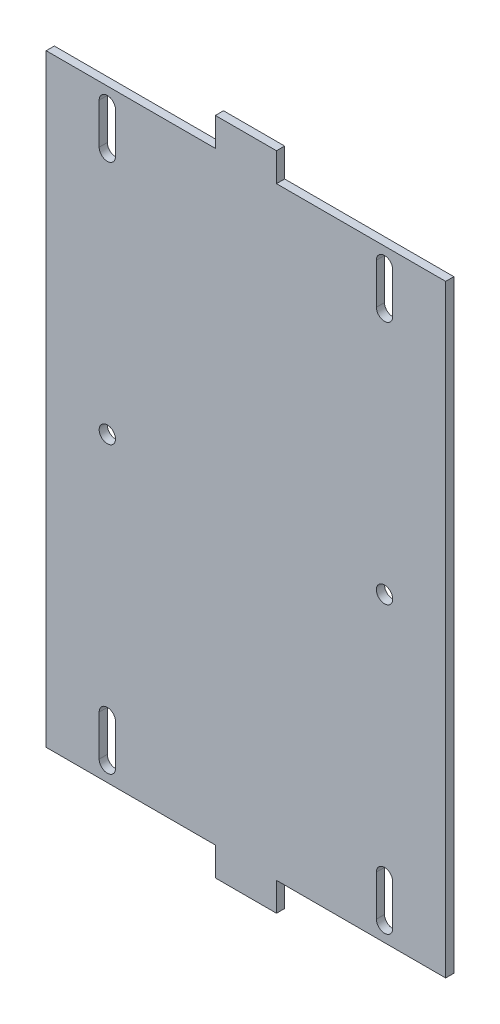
ISO-10303-21;
HEADER;
FILE_DESCRIPTION(('STEP AP214'),'2;1');
FILE_NAME('part.step','',(''),(''),'','','');
FILE_SCHEMA(('AUTOMOTIVE_DESIGN { 1 0 10303 214 1 1 1 1 }'));
ENDSEC;
DATA;
#1=APPLICATION_CONTEXT('core data for automotive mechanical design processes');
#2=APPLICATION_PROTOCOL_DEFINITION('international standard','automotive_design',2000,#1);
#3=PRODUCT_CONTEXT('',#1,'mechanical');
#4=PRODUCT('Part','Part','',(#3));
#5=PRODUCT_RELATED_PRODUCT_CATEGORY('part','',(#4));
#6=PRODUCT_DEFINITION_FORMATION('','',#4);
#7=PRODUCT_DEFINITION_CONTEXT('part definition',#1,'design');
#8=PRODUCT_DEFINITION('design','',#6,#7);
#9=PRODUCT_DEFINITION_SHAPE('','',#8);
#10=(LENGTH_UNIT() NAMED_UNIT(*) SI_UNIT(.MILLI.,.METRE.));
#11=(NAMED_UNIT(*) PLANE_ANGLE_UNIT() SI_UNIT($,.RADIAN.));
#12=(NAMED_UNIT(*) SI_UNIT($,.STERADIAN.) SOLID_ANGLE_UNIT());
#13=UNCERTAINTY_MEASURE_WITH_UNIT(LENGTH_MEASURE(1.E-05),#10,'distance_accuracy_value','');
#14=(GEOMETRIC_REPRESENTATION_CONTEXT(3) GLOBAL_UNCERTAINTY_ASSIGNED_CONTEXT((#13)) GLOBAL_UNIT_ASSIGNED_CONTEXT((#10,
#11,#12)) REPRESENTATION_CONTEXT('',''));
#15=CARTESIAN_POINT('',(0.,0.,0.));
#16=DIRECTION('',(0.,0.,1.));
#17=DIRECTION('',(1.,0.,0.));
#18=AXIS2_PLACEMENT_3D('',#15,#16,#17);
#19=CARTESIAN_POINT('',(-49.,74.,2.));
#20=DIRECTION('',(0.,-1.,0.));
#21=DIRECTION('',(0.,0.,-1.));
#22=AXIS2_PLACEMENT_3D('',#19,#20,#21);
#23=PLANE('',#22);
#24=DIRECTION('',(-1.,0.,0.));
#25=VECTOR('',#24,1.);
#26=CARTESIAN_POINT('',(-49.,74.,0.));
#27=LINE('',#26,#25);
#28=CARTESIAN_POINT('',(-7.49999999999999,74.,0.));
#29=VERTEX_POINT('',#28);
#30=CARTESIAN_POINT('',(-49.,74.,0.));
#31=VERTEX_POINT('',#30);
#32=EDGE_CURVE('E281',#29,#31,#27,.T.);
#33=ORIENTED_EDGE('',*,*,#32,.T.);
#34=DIRECTION('',(0.,0.,-1.));
#35=VECTOR('',#34,1.);
#36=CARTESIAN_POINT('',(-49.,74.,2.));
#37=LINE('',#36,#35);
#38=CARTESIAN_POINT('',(-49.,74.,2.));
#39=VERTEX_POINT('',#38);
#40=EDGE_CURVE('E370',#39,#31,#37,.T.);
#41=ORIENTED_EDGE('',*,*,#40,.F.);
#42=DIRECTION('',(-1.,0.,0.));
#43=VECTOR('',#42,1.);
#44=CARTESIAN_POINT('',(-49.,74.,2.));
#45=LINE('',#44,#43);
#46=CARTESIAN_POINT('',(-7.49999999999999,74.,2.));
#47=VERTEX_POINT('',#46);
#48=EDGE_CURVE('E312',#47,#39,#45,.T.);
#49=ORIENTED_EDGE('',*,*,#48,.F.);
#50=DIRECTION('',(0.,0.,-1.));
#51=VECTOR('',#50,1.);
#52=CARTESIAN_POINT('',(-7.49999999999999,74.,2.));
#53=LINE('',#52,#51);
#54=EDGE_CURVE('E337',#47,#29,#53,.T.);
#55=ORIENTED_EDGE('',*,*,#54,.T.);
#56=EDGE_LOOP('',(#33,#41,#49,#55));
#57=FACE_BOUND('',#56,.T.);
#58=ADVANCED_FACE('F26',(#57),#23,.F.);
#59=CARTESIAN_POINT('',(-49.,-74.,2.));
#60=DIRECTION('',(1.,0.,0.));
#61=DIRECTION('',(0.,0.,-1.));
#62=AXIS2_PLACEMENT_3D('',#59,#60,#61);
#63=PLANE('',#62);
#64=DIRECTION('',(0.,-1.,0.));
#65=VECTOR('',#64,1.);
#66=CARTESIAN_POINT('',(-49.,-74.,0.));
#67=LINE('',#66,#65);
#68=CARTESIAN_POINT('',(-49.,-74.,0.));
#69=VERTEX_POINT('',#68);
#70=EDGE_CURVE('E290',#31,#69,#67,.T.);
#71=ORIENTED_EDGE('',*,*,#70,.T.);
#72=DIRECTION('',(0.,0.,-1.));
#73=VECTOR('',#72,1.);
#74=CARTESIAN_POINT('',(-49.,-74.,2.));
#75=LINE('',#74,#73);
#76=CARTESIAN_POINT('',(-49.,-74.,2.));
#77=VERTEX_POINT('',#76);
#78=EDGE_CURVE('E367',#77,#69,#75,.T.);
#79=ORIENTED_EDGE('',*,*,#78,.F.);
#80=DIRECTION('',(0.,-1.,0.));
#81=VECTOR('',#80,1.);
#82=CARTESIAN_POINT('',(-49.,-74.,2.));
#83=LINE('',#82,#81);
#84=EDGE_CURVE('E315',#39,#77,#83,.T.);
#85=ORIENTED_EDGE('',*,*,#84,.F.);
#86=ORIENTED_EDGE('',*,*,#40,.T.);
#87=EDGE_LOOP('',(#71,#79,#85,#86));
#88=FACE_BOUND('',#87,.T.);
#89=ADVANCED_FACE('F453',(#88),#63,.F.);
#90=CARTESIAN_POINT('',(-49.,-74.,2.));
#91=DIRECTION('',(0.,1.,0.));
#92=DIRECTION('',(0.,0.,1.));
#93=AXIS2_PLACEMENT_3D('',#90,#91,#92);
#94=PLANE('',#93);
#95=DIRECTION('',(1.,0.,0.));
#96=VECTOR('',#95,1.);
#97=CARTESIAN_POINT('',(-49.,-74.,0.));
#98=LINE('',#97,#96);
#99=CARTESIAN_POINT('',(-7.49999999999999,-74.,0.));
#100=VERTEX_POINT('',#99);
#101=EDGE_CURVE('E292',#69,#100,#98,.T.);
#102=ORIENTED_EDGE('',*,*,#101,.T.);
#103=DIRECTION('',(0.,0.,-1.));
#104=VECTOR('',#103,1.);
#105=CARTESIAN_POINT('',(-7.49999999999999,-74.,2.));
#106=LINE('',#105,#104);
#107=CARTESIAN_POINT('',(-7.49999999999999,-74.,2.));
#108=VERTEX_POINT('',#107);
#109=EDGE_CURVE('E364',#108,#100,#106,.T.);
#110=ORIENTED_EDGE('',*,*,#109,.F.);
#111=DIRECTION('',(1.,0.,0.));
#112=VECTOR('',#111,1.);
#113=CARTESIAN_POINT('',(-49.,-74.,2.));
#114=LINE('',#113,#112);
#115=EDGE_CURVE('E317',#77,#108,#114,.T.);
#116=ORIENTED_EDGE('',*,*,#115,.F.);
#117=ORIENTED_EDGE('',*,*,#78,.T.);
#118=EDGE_LOOP('',(#102,#110,#116,#117));
#119=FACE_BOUND('',#118,.T.);
#120=ADVANCED_FACE('F459',(#119),#94,.F.);
#121=CARTESIAN_POINT('',(-7.49999999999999,-74.,2.));
#122=DIRECTION('',(1.,0.,0.));
#123=DIRECTION('',(0.,0.,-1.));
#124=AXIS2_PLACEMENT_3D('',#121,#122,#123);
#125=PLANE('',#124);
#126=DIRECTION('',(0.,-1.,0.));
#127=VECTOR('',#126,1.);
#128=CARTESIAN_POINT('',(-7.49999999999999,-74.,0.));
#129=LINE('',#128,#127);
#130=CARTESIAN_POINT('',(-7.49999999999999,-81.,0.));
#131=VERTEX_POINT('',#130);
#132=EDGE_CURVE('E294',#100,#131,#129,.T.);
#133=ORIENTED_EDGE('',*,*,#132,.T.);
#134=DIRECTION('',(0.,0.,-1.));
#135=VECTOR('',#134,1.);
#136=CARTESIAN_POINT('',(-7.49999999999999,-81.,2.));
#137=LINE('',#136,#135);
#138=CARTESIAN_POINT('',(-7.49999999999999,-81.,2.));
#139=VERTEX_POINT('',#138);
#140=EDGE_CURVE('E361',#139,#131,#137,.T.);
#141=ORIENTED_EDGE('',*,*,#140,.F.);
#142=DIRECTION('',(0.,-1.,0.));
#143=VECTOR('',#142,1.);
#144=CARTESIAN_POINT('',(-7.49999999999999,-74.,2.));
#145=LINE('',#144,#143);
#146=EDGE_CURVE('E319',#108,#139,#145,.T.);
#147=ORIENTED_EDGE('',*,*,#146,.F.);
#148=ORIENTED_EDGE('',*,*,#109,.T.);
#149=EDGE_LOOP('',(#133,#141,#147,#148));
#150=FACE_BOUND('',#149,.T.);
#151=ADVANCED_FACE('F548',(#150),#125,.F.);
#152=CARTESIAN_POINT('',(-7.49999999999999,-81.,2.));
#153=DIRECTION('',(0.,1.,0.));
#154=DIRECTION('',(0.,0.,1.));
#155=AXIS2_PLACEMENT_3D('',#152,#153,#154);
#156=PLANE('',#155);
#157=DIRECTION('',(1.,0.,0.));
#158=VECTOR('',#157,1.);
#159=CARTESIAN_POINT('',(-7.49999999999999,-81.,0.));
#160=LINE('',#159,#158);
#161=CARTESIAN_POINT('',(7.49999999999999,-81.,0.));
#162=VERTEX_POINT('',#161);
#163=EDGE_CURVE('E296',#131,#162,#160,.T.);
#164=ORIENTED_EDGE('',*,*,#163,.T.);
#165=DIRECTION('',(0.,0.,-1.));
#166=VECTOR('',#165,1.);
#167=CARTESIAN_POINT('',(7.49999999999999,-81.,2.));
#168=LINE('',#167,#166);
#169=CARTESIAN_POINT('',(7.49999999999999,-81.,2.));
#170=VERTEX_POINT('',#169);
#171=EDGE_CURVE('E358',#170,#162,#168,.T.);
#172=ORIENTED_EDGE('',*,*,#171,.F.);
#173=DIRECTION('',(1.,0.,0.));
#174=VECTOR('',#173,1.);
#175=CARTESIAN_POINT('',(-7.49999999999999,-81.,2.));
#176=LINE('',#175,#174);
#177=EDGE_CURVE('E321',#139,#170,#176,.T.);
#178=ORIENTED_EDGE('',*,*,#177,.F.);
#179=ORIENTED_EDGE('',*,*,#140,.T.);
#180=EDGE_LOOP('',(#164,#172,#178,#179));
#181=FACE_BOUND('',#180,.T.);
#182=ADVANCED_FACE('F544',(#181),#156,.F.);
#183=CARTESIAN_POINT('',(7.49999999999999,-74.,2.));
#184=DIRECTION('',(-1.,0.,0.));
#185=DIRECTION('',(0.,0.,1.));
#186=AXIS2_PLACEMENT_3D('',#183,#184,#185);
#187=PLANE('',#186);
#188=DIRECTION('',(0.,1.,0.));
#189=VECTOR('',#188,1.);
#190=CARTESIAN_POINT('',(7.49999999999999,-74.,0.));
#191=LINE('',#190,#189);
#192=CARTESIAN_POINT('',(7.49999999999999,-74.,0.));
#193=VERTEX_POINT('',#192);
#194=EDGE_CURVE('E298',#162,#193,#191,.T.);
#195=ORIENTED_EDGE('',*,*,#194,.T.);
#196=DIRECTION('',(0.,0.,-1.));
#197=VECTOR('',#196,1.);
#198=CARTESIAN_POINT('',(7.49999999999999,-74.,2.));
#199=LINE('',#198,#197);
#200=CARTESIAN_POINT('',(7.49999999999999,-74.,2.));
#201=VERTEX_POINT('',#200);
#202=EDGE_CURVE('E355',#201,#193,#199,.T.);
#203=ORIENTED_EDGE('',*,*,#202,.F.);
#204=DIRECTION('',(0.,1.,0.));
#205=VECTOR('',#204,1.);
#206=CARTESIAN_POINT('',(7.49999999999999,-74.,2.));
#207=LINE('',#206,#205);
#208=EDGE_CURVE('E323',#170,#201,#207,.T.);
#209=ORIENTED_EDGE('',*,*,#208,.F.);
#210=ORIENTED_EDGE('',*,*,#171,.T.);
#211=EDGE_LOOP('',(#195,#203,#209,#210));
#212=FACE_BOUND('',#211,.T.);
#213=ADVANCED_FACE('F540',(#212),#187,.F.);
#214=CARTESIAN_POINT('',(49.,-74.,2.));
#215=DIRECTION('',(0.,1.,0.));
#216=DIRECTION('',(0.,0.,1.));
#217=AXIS2_PLACEMENT_3D('',#214,#215,#216);
#218=PLANE('',#217);
#219=DIRECTION('',(1.,0.,0.));
#220=VECTOR('',#219,1.);
#221=CARTESIAN_POINT('',(49.,-74.,0.));
#222=LINE('',#221,#220);
#223=CARTESIAN_POINT('',(49.,-74.,0.));
#224=VERTEX_POINT('',#223);
#225=EDGE_CURVE('E300',#193,#224,#222,.T.);
#226=ORIENTED_EDGE('',*,*,#225,.T.);
#227=DIRECTION('',(0.,0.,-1.));
#228=VECTOR('',#227,1.);
#229=CARTESIAN_POINT('',(49.,-74.,2.));
#230=LINE('',#229,#228);
#231=CARTESIAN_POINT('',(49.,-74.,2.));
#232=VERTEX_POINT('',#231);
#233=EDGE_CURVE('E352',#232,#224,#230,.T.);
#234=ORIENTED_EDGE('',*,*,#233,.F.);
#235=DIRECTION('',(1.,0.,0.));
#236=VECTOR('',#235,1.);
#237=CARTESIAN_POINT('',(49.,-74.,2.));
#238=LINE('',#237,#236);
#239=EDGE_CURVE('E325',#201,#232,#238,.T.);
#240=ORIENTED_EDGE('',*,*,#239,.F.);
#241=ORIENTED_EDGE('',*,*,#202,.T.);
#242=EDGE_LOOP('',(#226,#234,#240,#241));
#243=FACE_BOUND('',#242,.T.);
#244=ADVANCED_FACE('F536',(#243),#218,.F.);
#245=CARTESIAN_POINT('',(49.,-74.,2.));
#246=DIRECTION('',(-1.,0.,0.));
#247=DIRECTION('',(0.,0.,1.));
#248=AXIS2_PLACEMENT_3D('',#245,#246,#247);
#249=PLANE('',#248);
#250=DIRECTION('',(0.,1.,0.));
#251=VECTOR('',#250,1.);
#252=CARTESIAN_POINT('',(49.,-74.,0.));
#253=LINE('',#252,#251);
#254=CARTESIAN_POINT('',(49.,74.,0.));
#255=VERTEX_POINT('',#254);
#256=EDGE_CURVE('E302',#224,#255,#253,.T.);
#257=ORIENTED_EDGE('',*,*,#256,.T.);
#258=DIRECTION('',(0.,0.,-1.));
#259=VECTOR('',#258,1.);
#260=CARTESIAN_POINT('',(49.,74.,2.));
#261=LINE('',#260,#259);
#262=CARTESIAN_POINT('',(49.,74.,2.));
#263=VERTEX_POINT('',#262);
#264=EDGE_CURVE('E349',#263,#255,#261,.T.);
#265=ORIENTED_EDGE('',*,*,#264,.F.);
#266=DIRECTION('',(0.,1.,0.));
#267=VECTOR('',#266,1.);
#268=CARTESIAN_POINT('',(49.,-74.,2.));
#269=LINE('',#268,#267);
#270=EDGE_CURVE('E327',#232,#263,#269,.T.);
#271=ORIENTED_EDGE('',*,*,#270,.F.);
#272=ORIENTED_EDGE('',*,*,#233,.T.);
#273=EDGE_LOOP('',(#257,#265,#271,#272));
#274=FACE_BOUND('',#273,.T.);
#275=ADVANCED_FACE('F532',(#274),#249,.F.);
#276=CARTESIAN_POINT('',(49.,74.,2.));
#277=DIRECTION('',(0.,-1.,0.));
#278=DIRECTION('',(0.,0.,-1.));
#279=AXIS2_PLACEMENT_3D('',#276,#277,#278);
#280=PLANE('',#279);
#281=DIRECTION('',(-1.,0.,0.));
#282=VECTOR('',#281,1.);
#283=CARTESIAN_POINT('',(49.,74.,0.));
#284=LINE('',#283,#282);
#285=CARTESIAN_POINT('',(7.49999999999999,74.,0.));
#286=VERTEX_POINT('',#285);
#287=EDGE_CURVE('E304',#255,#286,#284,.T.);
#288=ORIENTED_EDGE('',*,*,#287,.T.);
#289=DIRECTION('',(0.,0.,-1.));
#290=VECTOR('',#289,1.);
#291=CARTESIAN_POINT('',(7.49999999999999,74.,2.));
#292=LINE('',#291,#290);
#293=CARTESIAN_POINT('',(7.49999999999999,74.,2.));
#294=VERTEX_POINT('',#293);
#295=EDGE_CURVE('E346',#294,#286,#292,.T.);
#296=ORIENTED_EDGE('',*,*,#295,.F.);
#297=DIRECTION('',(-1.,0.,0.));
#298=VECTOR('',#297,1.);
#299=CARTESIAN_POINT('',(49.,74.,2.));
#300=LINE('',#299,#298);
#301=EDGE_CURVE('E329',#263,#294,#300,.T.);
#302=ORIENTED_EDGE('',*,*,#301,.F.);
#303=ORIENTED_EDGE('',*,*,#264,.T.);
#304=EDGE_LOOP('',(#288,#296,#302,#303));
#305=FACE_BOUND('',#304,.T.);
#306=ADVANCED_FACE('F528',(#305),#280,.F.);
#307=CARTESIAN_POINT('',(7.49999999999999,74.,2.));
#308=DIRECTION('',(-1.,0.,0.));
#309=DIRECTION('',(0.,0.,1.));
#310=AXIS2_PLACEMENT_3D('',#307,#308,#309);
#311=PLANE('',#310);
#312=DIRECTION('',(0.,1.,0.));
#313=VECTOR('',#312,1.);
#314=CARTESIAN_POINT('',(7.49999999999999,74.,0.));
#315=LINE('',#314,#313);
#316=CARTESIAN_POINT('',(7.49999999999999,81.,0.));
#317=VERTEX_POINT('',#316);
#318=EDGE_CURVE('E306',#286,#317,#315,.T.);
#319=ORIENTED_EDGE('',*,*,#318,.T.);
#320=DIRECTION('',(0.,0.,-1.));
#321=VECTOR('',#320,1.);
#322=CARTESIAN_POINT('',(7.49999999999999,81.,2.));
#323=LINE('',#322,#321);
#324=CARTESIAN_POINT('',(7.49999999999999,81.,2.));
#325=VERTEX_POINT('',#324);
#326=EDGE_CURVE('E343',#325,#317,#323,.T.);
#327=ORIENTED_EDGE('',*,*,#326,.F.);
#328=DIRECTION('',(0.,1.,0.));
#329=VECTOR('',#328,1.);
#330=CARTESIAN_POINT('',(7.49999999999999,74.,2.));
#331=LINE('',#330,#329);
#332=EDGE_CURVE('E331',#294,#325,#331,.T.);
#333=ORIENTED_EDGE('',*,*,#332,.F.);
#334=ORIENTED_EDGE('',*,*,#295,.T.);
#335=EDGE_LOOP('',(#319,#327,#333,#334));
#336=FACE_BOUND('',#335,.T.);
#337=ADVANCED_FACE('F524',(#336),#311,.F.);
#338=CARTESIAN_POINT('',(-7.49999999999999,81.,2.));
#339=DIRECTION('',(0.,-1.,0.));
#340=DIRECTION('',(0.,0.,-1.));
#341=AXIS2_PLACEMENT_3D('',#338,#339,#340);
#342=PLANE('',#341);
#343=DIRECTION('',(-1.,0.,0.));
#344=VECTOR('',#343,1.);
#345=CARTESIAN_POINT('',(-7.49999999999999,81.,0.));
#346=LINE('',#345,#344);
#347=CARTESIAN_POINT('',(-7.49999999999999,81.,0.));
#348=VERTEX_POINT('',#347);
#349=EDGE_CURVE('E308',#317,#348,#346,.T.);
#350=ORIENTED_EDGE('',*,*,#349,.T.);
#351=DIRECTION('',(0.,0.,-1.));
#352=VECTOR('',#351,1.);
#353=CARTESIAN_POINT('',(-7.49999999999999,81.,2.));
#354=LINE('',#353,#352);
#355=CARTESIAN_POINT('',(-7.49999999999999,81.,2.));
#356=VERTEX_POINT('',#355);
#357=EDGE_CURVE('E340',#356,#348,#354,.T.);
#358=ORIENTED_EDGE('',*,*,#357,.F.);
#359=DIRECTION('',(-1.,0.,0.));
#360=VECTOR('',#359,1.);
#361=CARTESIAN_POINT('',(-7.49999999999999,81.,2.));
#362=LINE('',#361,#360);
#363=EDGE_CURVE('E333',#325,#356,#362,.T.);
#364=ORIENTED_EDGE('',*,*,#363,.F.);
#365=ORIENTED_EDGE('',*,*,#326,.T.);
#366=EDGE_LOOP('',(#350,#358,#364,#365));
#367=FACE_BOUND('',#366,.T.);
#368=ADVANCED_FACE('F520',(#367),#342,.F.);
#369=CARTESIAN_POINT('',(-7.49999999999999,74.,2.));
#370=DIRECTION('',(1.,0.,0.));
#371=DIRECTION('',(0.,0.,-1.));
#372=AXIS2_PLACEMENT_3D('',#369,#370,#371);
#373=PLANE('',#372);
#374=DIRECTION('',(0.,-1.,0.));
#375=VECTOR('',#374,1.);
#376=CARTESIAN_POINT('',(-7.49999999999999,74.,0.));
#377=LINE('',#376,#375);
#378=EDGE_CURVE('E310',#348,#29,#377,.T.);
#379=ORIENTED_EDGE('',*,*,#378,.T.);
#380=ORIENTED_EDGE('',*,*,#54,.F.);
#381=DIRECTION('',(0.,-1.,0.));
#382=VECTOR('',#381,1.);
#383=CARTESIAN_POINT('',(-7.49999999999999,74.,2.));
#384=LINE('',#383,#382);
#385=EDGE_CURVE('E335',#356,#47,#384,.T.);
#386=ORIENTED_EDGE('',*,*,#385,.F.);
#387=ORIENTED_EDGE('',*,*,#357,.T.);
#388=EDGE_LOOP('',(#379,#380,#386,#387));
#389=FACE_BOUND('',#388,.T.);
#390=ADVANCED_FACE('F516',(#389),#373,.F.);
#391=CARTESIAN_POINT('',(-7.49999999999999,74.,2.));
#392=DIRECTION('',(0.,0.,1.));
#393=DIRECTION('',(1.,0.,0.));
#394=AXIS2_PLACEMENT_3D('',#391,#392,#393);
#395=PLANE('',#394);
#396=CARTESIAN_POINT('',(34.,0.,2.));
#397=DIRECTION('',(0.,0.,1.));
#398=DIRECTION('',(1.,0.,0.));
#399=AXIS2_PLACEMENT_3D('',#396,#397,#398);
#400=CIRCLE('',#399,2.);
#401=CARTESIAN_POINT('',(36.,0.,2.));
#402=VERTEX_POINT('',#401);
#403=EDGE_CURVE('E725',#402,#402,#400,.T.);
#404=ORIENTED_EDGE('',*,*,#403,.F.);
#405=EDGE_LOOP('',(#404));
#406=FACE_BOUND('',#405,.T.);
#407=CARTESIAN_POINT('',(-34.,0.,2.));
#408=DIRECTION('',(0.,0.,1.));
#409=DIRECTION('',(1.,0.,0.));
#410=AXIS2_PLACEMENT_3D('',#407,#408,#409);
#411=CIRCLE('',#410,2.);
#412=CARTESIAN_POINT('',(-32.,0.,2.));
#413=VERTEX_POINT('',#412);
#414=EDGE_CURVE('E729',#413,#413,#411,.T.);
#415=ORIENTED_EDGE('',*,*,#414,.F.);
#416=EDGE_LOOP('',(#415));
#417=FACE_BOUND('',#416,.T.);
#418=CARTESIAN_POINT('',(34.,70.,2.));
#419=DIRECTION('',(0.,0.,1.));
#420=DIRECTION('',(-1.,0.,0.));
#421=AXIS2_PLACEMENT_3D('',#418,#419,#420);
#422=CIRCLE('',#421,2.);
#423=CARTESIAN_POINT('',(36.,70.,2.));
#424=VERTEX_POINT('',#423);
#425=CARTESIAN_POINT('',(32.,70.,2.));
#426=VERTEX_POINT('',#425);
#427=EDGE_CURVE('E250',#424,#426,#422,.T.);
#428=ORIENTED_EDGE('',*,*,#427,.F.);
#429=DIRECTION('',(0.,1.,0.));
#430=VECTOR('',#429,1.);
#431=CARTESIAN_POINT('',(36.,70.,2.));
#432=LINE('',#431,#430);
#433=CARTESIAN_POINT('',(36.,60.,2.));
#434=VERTEX_POINT('',#433);
#435=EDGE_CURVE('E236',#434,#424,#432,.T.);
#436=ORIENTED_EDGE('',*,*,#435,.F.);
#437=CARTESIAN_POINT('',(34.,60.,2.));
#438=DIRECTION('',(0.,0.,1.));
#439=DIRECTION('',(1.,0.,0.));
#440=AXIS2_PLACEMENT_3D('',#437,#438,#439);
#441=CIRCLE('',#440,2.);
#442=CARTESIAN_POINT('',(32.,60.,2.));
#443=VERTEX_POINT('',#442);
#444=EDGE_CURVE('E228',#443,#434,#441,.T.);
#445=ORIENTED_EDGE('',*,*,#444,.F.);
#446=DIRECTION('',(0.,-1.,0.));
#447=VECTOR('',#446,1.);
#448=CARTESIAN_POINT('',(32.,70.,2.));
#449=LINE('',#448,#447);
#450=EDGE_CURVE('E214',#426,#443,#449,.T.);
#451=ORIENTED_EDGE('',*,*,#450,.F.);
#452=EDGE_LOOP('',(#428,#436,#445,#451));
#453=FACE_BOUND('',#452,.T.);
#454=CARTESIAN_POINT('',(-34.,70.,2.));
#455=DIRECTION('',(0.,0.,1.));
#456=DIRECTION('',(-1.,0.,0.));
#457=AXIS2_PLACEMENT_3D('',#454,#455,#456);
#458=CIRCLE('',#457,2.);
#459=CARTESIAN_POINT('',(-32.,70.,2.));
#460=VERTEX_POINT('',#459);
#461=CARTESIAN_POINT('',(-36.,70.,2.));
#462=VERTEX_POINT('',#461);
#463=EDGE_CURVE('E255',#460,#462,#458,.T.);
#464=ORIENTED_EDGE('',*,*,#463,.F.);
#465=DIRECTION('',(0.,1.,0.));
#466=VECTOR('',#465,1.);
#467=CARTESIAN_POINT('',(-32.,70.,2.));
#468=LINE('',#467,#466);
#469=CARTESIAN_POINT('',(-32.,60.,2.));
#470=VERTEX_POINT('',#469);
#471=EDGE_CURVE('E263',#470,#460,#468,.T.);
#472=ORIENTED_EDGE('',*,*,#471,.F.);
#473=CARTESIAN_POINT('',(-34.,60.,2.));
#474=DIRECTION('',(0.,0.,1.));
#475=DIRECTION('',(1.,0.,0.));
#476=AXIS2_PLACEMENT_3D('',#473,#474,#475);
#477=CIRCLE('',#476,2.);
#478=CARTESIAN_POINT('',(-36.,60.,2.));
#479=VERTEX_POINT('',#478);
#480=EDGE_CURVE('E260',#479,#470,#477,.T.);
#481=ORIENTED_EDGE('',*,*,#480,.F.);
#482=DIRECTION('',(0.,-1.,0.));
#483=VECTOR('',#482,1.);
#484=CARTESIAN_POINT('',(-36.,70.,2.));
#485=LINE('',#484,#483);
#486=EDGE_CURVE('E257',#462,#479,#485,.T.);
#487=ORIENTED_EDGE('',*,*,#486,.F.);
#488=EDGE_LOOP('',(#464,#472,#481,#487));
#489=FACE_BOUND('',#488,.T.);
#490=ORIENTED_EDGE('',*,*,#48,.T.);
#491=ORIENTED_EDGE('',*,*,#84,.T.);
#492=ORIENTED_EDGE('',*,*,#115,.T.);
#493=ORIENTED_EDGE('',*,*,#146,.T.);
#494=ORIENTED_EDGE('',*,*,#177,.T.);
#495=ORIENTED_EDGE('',*,*,#208,.T.);
#496=ORIENTED_EDGE('',*,*,#239,.T.);
#497=ORIENTED_EDGE('',*,*,#270,.T.);
#498=ORIENTED_EDGE('',*,*,#301,.T.);
#499=ORIENTED_EDGE('',*,*,#332,.T.);
#500=ORIENTED_EDGE('',*,*,#363,.T.);
#501=ORIENTED_EDGE('',*,*,#385,.T.);
#502=EDGE_LOOP('',(#490,#491,#492,#493,#494,#495,#496,#497,#498,#499,#500,#501));
#503=FACE_BOUND('',#502,.T.);
#504=CARTESIAN_POINT('',(-34.,-60.,2.));
#505=DIRECTION('',(0.,0.,1.));
#506=DIRECTION('',(-1.,0.,0.));
#507=AXIS2_PLACEMENT_3D('',#504,#505,#506);
#508=CIRCLE('',#507,2.);
#509=CARTESIAN_POINT('',(-32.,-60.,2.));
#510=VERTEX_POINT('',#509);
#511=CARTESIAN_POINT('',(-36.,-60.,2.));
#512=VERTEX_POINT('',#511);
#513=EDGE_CURVE('E373',#510,#512,#508,.T.);
#514=ORIENTED_EDGE('',*,*,#513,.F.);
#515=DIRECTION('',(0.,1.,0.));
#516=VECTOR('',#515,1.);
#517=CARTESIAN_POINT('',(-32.,-60.,2.));
#518=LINE('',#517,#516);
#519=CARTESIAN_POINT('',(-32.,-70.,2.));
#520=VERTEX_POINT('',#519);
#521=EDGE_CURVE('E375',#520,#510,#518,.T.);
#522=ORIENTED_EDGE('',*,*,#521,.F.);
#523=CARTESIAN_POINT('',(-34.,-70.,2.));
#524=DIRECTION('',(0.,0.,1.));
#525=DIRECTION('',(1.,0.,0.));
#526=AXIS2_PLACEMENT_3D('',#523,#524,#525);
#527=CIRCLE('',#526,2.);
#528=CARTESIAN_POINT('',(-36.,-70.,2.));
#529=VERTEX_POINT('',#528);
#530=EDGE_CURVE('E378',#529,#520,#527,.T.);
#531=ORIENTED_EDGE('',*,*,#530,.F.);
#532=DIRECTION('',(0.,-1.,0.));
#533=VECTOR('',#532,1.);
#534=CARTESIAN_POINT('',(-36.,-60.,2.));
#535=LINE('',#534,#533);
#536=EDGE_CURVE('E381',#512,#529,#535,.T.);
#537=ORIENTED_EDGE('',*,*,#536,.F.);
#538=EDGE_LOOP('',(#514,#522,#531,#537));
#539=FACE_BOUND('',#538,.T.);
#540=CARTESIAN_POINT('',(34.,-60.,2.));
#541=DIRECTION('',(0.,0.,1.));
#542=DIRECTION('',(-1.,0.,0.));
#543=AXIS2_PLACEMENT_3D('',#540,#541,#542);
#544=CIRCLE('',#543,2.);
#545=CARTESIAN_POINT('',(36.,-60.,2.));
#546=VERTEX_POINT('',#545);
#547=CARTESIAN_POINT('',(32.,-60.,2.));
#548=VERTEX_POINT('',#547);
#549=EDGE_CURVE('E405',#546,#548,#544,.T.);
#550=ORIENTED_EDGE('',*,*,#549,.F.);
#551=DIRECTION('',(0.,1.,0.));
#552=VECTOR('',#551,1.);
#553=CARTESIAN_POINT('',(36.,-60.,2.));
#554=LINE('',#553,#552);
#555=CARTESIAN_POINT('',(36.,-70.,2.));
#556=VERTEX_POINT('',#555);
#557=EDGE_CURVE('E407',#556,#546,#554,.T.);
#558=ORIENTED_EDGE('',*,*,#557,.F.);
#559=CARTESIAN_POINT('',(34.,-70.,2.));
#560=DIRECTION('',(0.,0.,1.));
#561=DIRECTION('',(1.,0.,0.));
#562=AXIS2_PLACEMENT_3D('',#559,#560,#561);
#563=CIRCLE('',#562,2.);
#564=CARTESIAN_POINT('',(32.,-70.,2.));
#565=VERTEX_POINT('',#564);
#566=EDGE_CURVE('E410',#565,#556,#563,.T.);
#567=ORIENTED_EDGE('',*,*,#566,.F.);
#568=DIRECTION('',(0.,-1.,0.));
#569=VECTOR('',#568,1.);
#570=CARTESIAN_POINT('',(32.,-60.,2.));
#571=LINE('',#570,#569);
#572=EDGE_CURVE('E413',#548,#565,#571,.T.);
#573=ORIENTED_EDGE('',*,*,#572,.F.);
#574=EDGE_LOOP('',(#550,#558,#567,#573));
#575=FACE_BOUND('',#574,.T.);
#576=ADVANCED_FACE('F234',(#406,#417,#453,#489,#503,#539,#575),#395,.T.);
#577=CARTESIAN_POINT('',(-7.49999999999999,74.,0.));
#578=DIRECTION('',(0.,0.,1.));
#579=DIRECTION('',(1.,0.,0.));
#580=AXIS2_PLACEMENT_3D('',#577,#578,#579);
#581=PLANE('',#580);
#582=CARTESIAN_POINT('',(34.,0.,0.));
#583=DIRECTION('',(0.,0.,1.));
#584=DIRECTION('',(1.,0.,0.));
#585=AXIS2_PLACEMENT_3D('',#582,#583,#584);
#586=CIRCLE('',#585,2.);
#587=CARTESIAN_POINT('',(36.,0.,0.));
#588=VERTEX_POINT('',#587);
#589=EDGE_CURVE('E728',#588,#588,#586,.T.);
#590=ORIENTED_EDGE('',*,*,#589,.T.);
#591=EDGE_LOOP('',(#590));
#592=FACE_BOUND('',#591,.T.);
#593=CARTESIAN_POINT('',(-34.,0.,0.));
#594=DIRECTION('',(0.,0.,1.));
#595=DIRECTION('',(1.,0.,0.));
#596=AXIS2_PLACEMENT_3D('',#593,#594,#595);
#597=CIRCLE('',#596,2.);
#598=CARTESIAN_POINT('',(-32.,0.,0.));
#599=VERTEX_POINT('',#598);
#600=EDGE_CURVE('E30',#599,#599,#597,.T.);
#601=ORIENTED_EDGE('',*,*,#600,.T.);
#602=EDGE_LOOP('',(#601));
#603=FACE_BOUND('',#602,.T.);
#604=DIRECTION('',(0.,1.,0.));
#605=VECTOR('',#604,1.);
#606=CARTESIAN_POINT('',(36.,70.,0.));
#607=LINE('',#606,#605);
#608=CARTESIAN_POINT('',(36.,60.,0.));
#609=VERTEX_POINT('',#608);
#610=CARTESIAN_POINT('',(36.,70.,0.));
#611=VERTEX_POINT('',#610);
#612=EDGE_CURVE('E247',#609,#611,#607,.T.);
#613=ORIENTED_EDGE('',*,*,#612,.T.);
#614=CARTESIAN_POINT('',(34.,70.,0.));
#615=DIRECTION('',(0.,0.,1.));
#616=DIRECTION('',(-1.,0.,0.));
#617=AXIS2_PLACEMENT_3D('',#614,#615,#616);
#618=CIRCLE('',#617,2.);
#619=CARTESIAN_POINT('',(32.,70.,0.));
#620=VERTEX_POINT('',#619);
#621=EDGE_CURVE('E252',#611,#620,#618,.T.);
#622=ORIENTED_EDGE('',*,*,#621,.T.);
#623=DIRECTION('',(0.,-1.,0.));
#624=VECTOR('',#623,1.);
#625=CARTESIAN_POINT('',(32.,70.,0.));
#626=LINE('',#625,#624);
#627=CARTESIAN_POINT('',(32.,60.,0.));
#628=VERTEX_POINT('',#627);
#629=EDGE_CURVE('E224',#620,#628,#626,.T.);
#630=ORIENTED_EDGE('',*,*,#629,.T.);
#631=CARTESIAN_POINT('',(34.,60.,0.));
#632=DIRECTION('',(0.,0.,1.));
#633=DIRECTION('',(1.,0.,0.));
#634=AXIS2_PLACEMENT_3D('',#631,#632,#633);
#635=CIRCLE('',#634,2.);
#636=EDGE_CURVE('E231',#628,#609,#635,.T.);
#637=ORIENTED_EDGE('',*,*,#636,.T.);
#638=EDGE_LOOP('',(#613,#622,#630,#637));
#639=FACE_BOUND('',#638,.T.);
#640=DIRECTION('',(0.,1.,0.));
#641=VECTOR('',#640,1.);
#642=CARTESIAN_POINT('',(-32.,70.,0.));
#643=LINE('',#642,#641);
#644=CARTESIAN_POINT('',(-32.,60.,0.));
#645=VERTEX_POINT('',#644);
#646=CARTESIAN_POINT('',(-32.,70.,0.));
#647=VERTEX_POINT('',#646);
#648=EDGE_CURVE('E275',#645,#647,#643,.T.);
#649=ORIENTED_EDGE('',*,*,#648,.T.);
#650=CARTESIAN_POINT('',(-34.,70.,0.));
#651=DIRECTION('',(0.,0.,1.));
#652=DIRECTION('',(-1.,0.,0.));
#653=AXIS2_PLACEMENT_3D('',#650,#651,#652);
#654=CIRCLE('',#653,2.);
#655=CARTESIAN_POINT('',(-36.,70.,0.));
#656=VERTEX_POINT('',#655);
#657=EDGE_CURVE('E266',#647,#656,#654,.T.);
#658=ORIENTED_EDGE('',*,*,#657,.T.);
#659=DIRECTION('',(0.,-1.,0.));
#660=VECTOR('',#659,1.);
#661=CARTESIAN_POINT('',(-36.,70.,0.));
#662=LINE('',#661,#660);
#663=CARTESIAN_POINT('',(-36.,60.,0.));
#664=VERTEX_POINT('',#663);
#665=EDGE_CURVE('E269',#656,#664,#662,.T.);
#666=ORIENTED_EDGE('',*,*,#665,.T.);
#667=CARTESIAN_POINT('',(-34.,60.,0.));
#668=DIRECTION('',(0.,0.,1.));
#669=DIRECTION('',(1.,0.,0.));
#670=AXIS2_PLACEMENT_3D('',#667,#668,#669);
#671=CIRCLE('',#670,2.);
#672=EDGE_CURVE('E272',#664,#645,#671,.T.);
#673=ORIENTED_EDGE('',*,*,#672,.T.);
#674=EDGE_LOOP('',(#649,#658,#666,#673));
#675=FACE_BOUND('',#674,.T.);
#676=ORIENTED_EDGE('',*,*,#32,.F.);
#677=ORIENTED_EDGE('',*,*,#378,.F.);
#678=ORIENTED_EDGE('',*,*,#349,.F.);
#679=ORIENTED_EDGE('',*,*,#318,.F.);
#680=ORIENTED_EDGE('',*,*,#287,.F.);
#681=ORIENTED_EDGE('',*,*,#256,.F.);
#682=ORIENTED_EDGE('',*,*,#225,.F.);
#683=ORIENTED_EDGE('',*,*,#194,.F.);
#684=ORIENTED_EDGE('',*,*,#163,.F.);
#685=ORIENTED_EDGE('',*,*,#132,.F.);
#686=ORIENTED_EDGE('',*,*,#101,.F.);
#687=ORIENTED_EDGE('',*,*,#70,.F.);
#688=EDGE_LOOP('',(#676,#677,#678,#679,#680,#681,#682,#683,#684,#685,#686,#687));
#689=FACE_BOUND('',#688,.T.);
#690=CARTESIAN_POINT('',(-34.,-60.,0.));
#691=DIRECTION('',(0.,0.,1.));
#692=DIRECTION('',(-1.,0.,0.));
#693=AXIS2_PLACEMENT_3D('',#690,#691,#692);
#694=CIRCLE('',#693,2.);
#695=CARTESIAN_POINT('',(-32.,-60.,0.));
#696=VERTEX_POINT('',#695);
#697=CARTESIAN_POINT('',(-36.,-60.,0.));
#698=VERTEX_POINT('',#697);
#699=EDGE_CURVE('E384',#696,#698,#694,.T.);
#700=ORIENTED_EDGE('',*,*,#699,.T.);
#701=DIRECTION('',(0.,-1.,0.));
#702=VECTOR('',#701,1.);
#703=CARTESIAN_POINT('',(-36.,-60.,0.));
#704=LINE('',#703,#702);
#705=CARTESIAN_POINT('',(-36.,-70.,0.));
#706=VERTEX_POINT('',#705);
#707=EDGE_CURVE('E386',#698,#706,#704,.T.);
#708=ORIENTED_EDGE('',*,*,#707,.T.);
#709=CARTESIAN_POINT('',(-34.,-70.,0.));
#710=DIRECTION('',(0.,0.,1.));
#711=DIRECTION('',(1.,0.,0.));
#712=AXIS2_PLACEMENT_3D('',#709,#710,#711);
#713=CIRCLE('',#712,2.);
#714=CARTESIAN_POINT('',(-32.,-70.,0.));
#715=VERTEX_POINT('',#714);
#716=EDGE_CURVE('E388',#706,#715,#713,.T.);
#717=ORIENTED_EDGE('',*,*,#716,.T.);
#718=DIRECTION('',(0.,1.,0.));
#719=VECTOR('',#718,1.);
#720=CARTESIAN_POINT('',(-32.,-60.,0.));
#721=LINE('',#720,#719);
#722=EDGE_CURVE('E390',#715,#696,#721,.T.);
#723=ORIENTED_EDGE('',*,*,#722,.T.);
#724=EDGE_LOOP('',(#700,#708,#717,#723));
#725=FACE_BOUND('',#724,.T.);
#726=CARTESIAN_POINT('',(34.,-60.,0.));
#727=DIRECTION('',(0.,0.,1.));
#728=DIRECTION('',(-1.,0.,0.));
#729=AXIS2_PLACEMENT_3D('',#726,#727,#728);
#730=CIRCLE('',#729,2.);
#731=CARTESIAN_POINT('',(36.,-60.,0.));
#732=VERTEX_POINT('',#731);
#733=CARTESIAN_POINT('',(32.,-60.,0.));
#734=VERTEX_POINT('',#733);
#735=EDGE_CURVE('E42',#732,#734,#730,.T.);
#736=ORIENTED_EDGE('',*,*,#735,.T.);
#737=DIRECTION('',(0.,-1.,0.));
#738=VECTOR('',#737,1.);
#739=CARTESIAN_POINT('',(32.,-60.,0.));
#740=LINE('',#739,#738);
#741=CARTESIAN_POINT('',(32.,-70.,0.));
#742=VERTEX_POINT('',#741);
#743=EDGE_CURVE('E417',#734,#742,#740,.T.);
#744=ORIENTED_EDGE('',*,*,#743,.T.);
#745=CARTESIAN_POINT('',(34.,-70.,0.));
#746=DIRECTION('',(0.,0.,1.));
#747=DIRECTION('',(1.,0.,0.));
#748=AXIS2_PLACEMENT_3D('',#745,#746,#747);
#749=CIRCLE('',#748,2.);
#750=CARTESIAN_POINT('',(36.,-70.,0.));
#751=VERTEX_POINT('',#750);
#752=EDGE_CURVE('E49',#742,#751,#749,.T.);
#753=ORIENTED_EDGE('',*,*,#752,.T.);
#754=DIRECTION('',(0.,1.,0.));
#755=VECTOR('',#754,1.);
#756=CARTESIAN_POINT('',(36.,-60.,0.));
#757=LINE('',#756,#755);
#758=EDGE_CURVE('E420',#751,#732,#757,.T.);
#759=ORIENTED_EDGE('',*,*,#758,.T.);
#760=EDGE_LOOP('',(#736,#744,#753,#759));
#761=FACE_BOUND('',#760,.T.);
#762=ADVANCED_FACE('F509',(#592,#603,#639,#675,#689,#725,#761),#581,.F.);
#763=CARTESIAN_POINT('',(-34.,70.,0.));
#764=DIRECTION('',(0.,0.,1.));
#765=DIRECTION('',(1.,0.,0.));
#766=AXIS2_PLACEMENT_3D('',#763,#764,#765);
#767=CYLINDRICAL_SURFACE('',#766,2.);
#768=ORIENTED_EDGE('',*,*,#463,.T.);
#769=DIRECTION('',(0.,0.,1.));
#770=VECTOR('',#769,1.);
#771=CARTESIAN_POINT('',(-36.,70.,0.));
#772=LINE('',#771,#770);
#773=EDGE_CURVE('E278',#656,#462,#772,.T.);
#774=ORIENTED_EDGE('',*,*,#773,.F.);
#775=ORIENTED_EDGE('',*,*,#657,.F.);
#776=DIRECTION('',(0.,0.,1.));
#777=VECTOR('',#776,1.);
#778=CARTESIAN_POINT('',(-32.,70.,0.));
#779=LINE('',#778,#777);
#780=EDGE_CURVE('E279',#647,#460,#779,.T.);
#781=ORIENTED_EDGE('',*,*,#780,.T.);
#782=EDGE_LOOP('',(#768,#774,#775,#781));
#783=FACE_BOUND('',#782,.T.);
#784=ADVANCED_FACE('F502',(#783),#767,.F.);
#785=CARTESIAN_POINT('',(-32.,70.,0.));
#786=DIRECTION('',(1.,0.,0.));
#787=DIRECTION('',(0.,0.,-1.));
#788=AXIS2_PLACEMENT_3D('',#785,#786,#787);
#789=PLANE('',#788);
#790=ORIENTED_EDGE('',*,*,#471,.T.);
#791=ORIENTED_EDGE('',*,*,#780,.F.);
#792=ORIENTED_EDGE('',*,*,#648,.F.);
#793=DIRECTION('',(0.,0.,1.));
#794=VECTOR('',#793,1.);
#795=CARTESIAN_POINT('',(-32.,60.,0.));
#796=LINE('',#795,#794);
#797=EDGE_CURVE('E282',#645,#470,#796,.T.);
#798=ORIENTED_EDGE('',*,*,#797,.T.);
#799=EDGE_LOOP('',(#790,#791,#792,#798));
#800=FACE_BOUND('',#799,.T.);
#801=ADVANCED_FACE('F499',(#800),#789,.F.);
#802=CARTESIAN_POINT('',(-34.,60.,0.));
#803=DIRECTION('',(0.,0.,1.));
#804=DIRECTION('',(1.,0.,0.));
#805=AXIS2_PLACEMENT_3D('',#802,#803,#804);
#806=CYLINDRICAL_SURFACE('',#805,2.);
#807=ORIENTED_EDGE('',*,*,#480,.T.);
#808=ORIENTED_EDGE('',*,*,#797,.F.);
#809=ORIENTED_EDGE('',*,*,#672,.F.);
#810=DIRECTION('',(0.,0.,1.));
#811=VECTOR('',#810,1.);
#812=CARTESIAN_POINT('',(-36.,60.,0.));
#813=LINE('',#812,#811);
#814=EDGE_CURVE('E284',#664,#479,#813,.T.);
#815=ORIENTED_EDGE('',*,*,#814,.T.);
#816=EDGE_LOOP('',(#807,#808,#809,#815));
#817=FACE_BOUND('',#816,.T.);
#818=ADVANCED_FACE('F494',(#817),#806,.F.);
#819=CARTESIAN_POINT('',(-36.,70.,0.));
#820=DIRECTION('',(-1.,0.,0.));
#821=DIRECTION('',(0.,0.,1.));
#822=AXIS2_PLACEMENT_3D('',#819,#820,#821);
#823=PLANE('',#822);
#824=ORIENTED_EDGE('',*,*,#486,.T.);
#825=ORIENTED_EDGE('',*,*,#814,.F.);
#826=ORIENTED_EDGE('',*,*,#665,.F.);
#827=ORIENTED_EDGE('',*,*,#773,.T.);
#828=EDGE_LOOP('',(#824,#825,#826,#827));
#829=FACE_BOUND('',#828,.T.);
#830=ADVANCED_FACE('F483',(#829),#823,.F.);
#831=CARTESIAN_POINT('',(34.,70.,0.));
#832=DIRECTION('',(0.,0.,1.));
#833=DIRECTION('',(1.,0.,0.));
#834=AXIS2_PLACEMENT_3D('',#831,#832,#833);
#835=CYLINDRICAL_SURFACE('',#834,2.);
#836=ORIENTED_EDGE('',*,*,#427,.T.);
#837=DIRECTION('',(0.,0.,1.));
#838=VECTOR('',#837,1.);
#839=CARTESIAN_POINT('',(32.,70.,0.));
#840=LINE('',#839,#838);
#841=EDGE_CURVE('E220',#620,#426,#840,.T.);
#842=ORIENTED_EDGE('',*,*,#841,.F.);
#843=ORIENTED_EDGE('',*,*,#621,.F.);
#844=DIRECTION('',(0.,0.,1.));
#845=VECTOR('',#844,1.);
#846=CARTESIAN_POINT('',(36.,70.,0.));
#847=LINE('',#846,#845);
#848=EDGE_CURVE('E244',#611,#424,#847,.T.);
#849=ORIENTED_EDGE('',*,*,#848,.T.);
#850=EDGE_LOOP('',(#836,#842,#843,#849));
#851=FACE_BOUND('',#850,.T.);
#852=ADVANCED_FACE('F478',(#851),#835,.F.);
#853=CARTESIAN_POINT('',(36.,70.,0.));
#854=DIRECTION('',(1.,0.,0.));
#855=DIRECTION('',(0.,0.,-1.));
#856=AXIS2_PLACEMENT_3D('',#853,#854,#855);
#857=PLANE('',#856);
#858=ORIENTED_EDGE('',*,*,#435,.T.);
#859=ORIENTED_EDGE('',*,*,#848,.F.);
#860=ORIENTED_EDGE('',*,*,#612,.F.);
#861=DIRECTION('',(0.,0.,1.));
#862=VECTOR('',#861,1.);
#863=CARTESIAN_POINT('',(36.,60.,0.));
#864=LINE('',#863,#862);
#865=EDGE_CURVE('E237',#609,#434,#864,.T.);
#866=ORIENTED_EDGE('',*,*,#865,.T.);
#867=EDGE_LOOP('',(#858,#859,#860,#866));
#868=FACE_BOUND('',#867,.T.);
#869=ADVANCED_FACE('F485',(#868),#857,.F.);
#870=CARTESIAN_POINT('',(34.,60.,0.));
#871=DIRECTION('',(0.,0.,1.));
#872=DIRECTION('',(1.,0.,0.));
#873=AXIS2_PLACEMENT_3D('',#870,#871,#872);
#874=CYLINDRICAL_SURFACE('',#873,2.);
#875=ORIENTED_EDGE('',*,*,#444,.T.);
#876=ORIENTED_EDGE('',*,*,#865,.F.);
#877=ORIENTED_EDGE('',*,*,#636,.F.);
#878=DIRECTION('',(0.,0.,1.));
#879=VECTOR('',#878,1.);
#880=CARTESIAN_POINT('',(32.,60.,0.));
#881=LINE('',#880,#879);
#882=EDGE_CURVE('E217',#628,#443,#881,.T.);
#883=ORIENTED_EDGE('',*,*,#882,.T.);
#884=EDGE_LOOP('',(#875,#876,#877,#883));
#885=FACE_BOUND('',#884,.T.);
#886=ADVANCED_FACE('F227',(#885),#874,.F.);
#887=CARTESIAN_POINT('',(32.,70.,0.));
#888=DIRECTION('',(-1.,0.,0.));
#889=DIRECTION('',(0.,0.,1.));
#890=AXIS2_PLACEMENT_3D('',#887,#888,#889);
#891=PLANE('',#890);
#892=ORIENTED_EDGE('',*,*,#450,.T.);
#893=ORIENTED_EDGE('',*,*,#882,.F.);
#894=ORIENTED_EDGE('',*,*,#629,.F.);
#895=ORIENTED_EDGE('',*,*,#841,.T.);
#896=EDGE_LOOP('',(#892,#893,#894,#895));
#897=FACE_BOUND('',#896,.T.);
#898=ADVANCED_FACE('F216',(#897),#891,.F.);
#899=CARTESIAN_POINT('',(-36.,-60.,0.));
#900=DIRECTION('',(-1.,0.,0.));
#901=DIRECTION('',(0.,0.,1.));
#902=AXIS2_PLACEMENT_3D('',#899,#900,#901);
#903=PLANE('',#902);
#904=ORIENTED_EDGE('',*,*,#536,.T.);
#905=DIRECTION('',(0.,0.,1.));
#906=VECTOR('',#905,1.);
#907=CARTESIAN_POINT('',(-36.,-70.,0.));
#908=LINE('',#907,#906);
#909=EDGE_CURVE('E402',#706,#529,#908,.T.);
#910=ORIENTED_EDGE('',*,*,#909,.F.);
#911=ORIENTED_EDGE('',*,*,#707,.F.);
#912=DIRECTION('',(0.,0.,1.));
#913=VECTOR('',#912,1.);
#914=CARTESIAN_POINT('',(-36.,-60.,0.));
#915=LINE('',#914,#913);
#916=EDGE_CURVE('E393',#698,#512,#915,.T.);
#917=ORIENTED_EDGE('',*,*,#916,.T.);
#918=EDGE_LOOP('',(#904,#910,#911,#917));
#919=FACE_BOUND('',#918,.T.);
#920=ADVANCED_FACE('F474',(#919),#903,.F.);
#921=CARTESIAN_POINT('',(-34.,-70.,0.));
#922=DIRECTION('',(0.,0.,1.));
#923=DIRECTION('',(1.,0.,0.));
#924=AXIS2_PLACEMENT_3D('',#921,#922,#923);
#925=CYLINDRICAL_SURFACE('',#924,2.);
#926=ORIENTED_EDGE('',*,*,#530,.T.);
#927=DIRECTION('',(0.,0.,1.));
#928=VECTOR('',#927,1.);
#929=CARTESIAN_POINT('',(-32.,-70.,0.));
#930=LINE('',#929,#928);
#931=EDGE_CURVE('E399',#715,#520,#930,.T.);
#932=ORIENTED_EDGE('',*,*,#931,.F.);
#933=ORIENTED_EDGE('',*,*,#716,.F.);
#934=ORIENTED_EDGE('',*,*,#909,.T.);
#935=EDGE_LOOP('',(#926,#932,#933,#934));
#936=FACE_BOUND('',#935,.T.);
#937=ADVANCED_FACE('F471',(#936),#925,.F.);
#938=CARTESIAN_POINT('',(-32.,-60.,0.));
#939=DIRECTION('',(1.,0.,0.));
#940=DIRECTION('',(0.,0.,-1.));
#941=AXIS2_PLACEMENT_3D('',#938,#939,#940);
#942=PLANE('',#941);
#943=ORIENTED_EDGE('',*,*,#521,.T.);
#944=DIRECTION('',(0.,0.,1.));
#945=VECTOR('',#944,1.);
#946=CARTESIAN_POINT('',(-32.,-60.,0.));
#947=LINE('',#946,#945);
#948=EDGE_CURVE('E396',#696,#510,#947,.T.);
#949=ORIENTED_EDGE('',*,*,#948,.F.);
#950=ORIENTED_EDGE('',*,*,#722,.F.);
#951=ORIENTED_EDGE('',*,*,#931,.T.);
#952=EDGE_LOOP('',(#943,#949,#950,#951));
#953=FACE_BOUND('',#952,.T.);
#954=ADVANCED_FACE('F467',(#953),#942,.F.);
#955=CARTESIAN_POINT('',(-34.,-60.,0.));
#956=DIRECTION('',(0.,0.,1.));
#957=DIRECTION('',(1.,0.,0.));
#958=AXIS2_PLACEMENT_3D('',#955,#956,#957);
#959=CYLINDRICAL_SURFACE('',#958,2.);
#960=ORIENTED_EDGE('',*,*,#513,.T.);
#961=ORIENTED_EDGE('',*,*,#916,.F.);
#962=ORIENTED_EDGE('',*,*,#699,.F.);
#963=ORIENTED_EDGE('',*,*,#948,.T.);
#964=EDGE_LOOP('',(#960,#961,#962,#963));
#965=FACE_BOUND('',#964,.T.);
#966=ADVANCED_FACE('F464',(#965),#959,.F.);
#967=CARTESIAN_POINT('',(32.,-60.,0.));
#968=DIRECTION('',(-1.,0.,0.));
#969=DIRECTION('',(0.,0.,1.));
#970=AXIS2_PLACEMENT_3D('',#967,#968,#969);
#971=PLANE('',#970);
#972=ORIENTED_EDGE('',*,*,#572,.T.);
#973=DIRECTION('',(0.,0.,1.));
#974=VECTOR('',#973,1.);
#975=CARTESIAN_POINT('',(32.,-70.,0.));
#976=LINE('',#975,#974);
#977=EDGE_CURVE('E11',#742,#565,#976,.T.);
#978=ORIENTED_EDGE('',*,*,#977,.F.);
#979=ORIENTED_EDGE('',*,*,#743,.F.);
#980=DIRECTION('',(0.,0.,1.));
#981=VECTOR('',#980,1.);
#982=CARTESIAN_POINT('',(32.,-60.,0.));
#983=LINE('',#982,#981);
#984=EDGE_CURVE('E422',#734,#548,#983,.T.);
#985=ORIENTED_EDGE('',*,*,#984,.T.);
#986=EDGE_LOOP('',(#972,#978,#979,#985));
#987=FACE_BOUND('',#986,.T.);
#988=ADVANCED_FACE('F28',(#987),#971,.F.);
#989=CARTESIAN_POINT('',(34.,-70.,0.));
#990=DIRECTION('',(0.,0.,1.));
#991=DIRECTION('',(1.,0.,0.));
#992=AXIS2_PLACEMENT_3D('',#989,#990,#991);
#993=CYLINDRICAL_SURFACE('',#992,2.);
#994=ORIENTED_EDGE('',*,*,#566,.T.);
#995=DIRECTION('',(0.,0.,1.));
#996=VECTOR('',#995,1.);
#997=CARTESIAN_POINT('',(36.,-70.,0.));
#998=LINE('',#997,#996);
#999=EDGE_CURVE('E35',#751,#556,#998,.T.);
#1000=ORIENTED_EDGE('',*,*,#999,.F.);
#1001=ORIENTED_EDGE('',*,*,#752,.F.);
#1002=ORIENTED_EDGE('',*,*,#977,.T.);
#1003=EDGE_LOOP('',(#994,#1000,#1001,#1002));
#1004=FACE_BOUND('',#1003,.T.);
#1005=ADVANCED_FACE('F433',(#1004),#993,.F.);
#1006=CARTESIAN_POINT('',(36.,-60.,0.));
#1007=DIRECTION('',(1.,0.,0.));
#1008=DIRECTION('',(0.,0.,-1.));
#1009=AXIS2_PLACEMENT_3D('',#1006,#1007,#1008);
#1010=PLANE('',#1009);
#1011=ORIENTED_EDGE('',*,*,#557,.T.);
#1012=DIRECTION('',(0.,0.,1.));
#1013=VECTOR('',#1012,1.);
#1014=CARTESIAN_POINT('',(36.,-60.,0.));
#1015=LINE('',#1014,#1013);
#1016=EDGE_CURVE('E425',#732,#546,#1015,.T.);
#1017=ORIENTED_EDGE('',*,*,#1016,.F.);
#1018=ORIENTED_EDGE('',*,*,#758,.F.);
#1019=ORIENTED_EDGE('',*,*,#999,.T.);
#1020=EDGE_LOOP('',(#1011,#1017,#1018,#1019));
#1021=FACE_BOUND('',#1020,.T.);
#1022=ADVANCED_FACE('F430',(#1021),#1010,.F.);
#1023=CARTESIAN_POINT('',(34.,-60.,0.));
#1024=DIRECTION('',(0.,0.,1.));
#1025=DIRECTION('',(1.,0.,0.));
#1026=AXIS2_PLACEMENT_3D('',#1023,#1024,#1025);
#1027=CYLINDRICAL_SURFACE('',#1026,2.);
#1028=ORIENTED_EDGE('',*,*,#549,.T.);
#1029=ORIENTED_EDGE('',*,*,#984,.F.);
#1030=ORIENTED_EDGE('',*,*,#735,.F.);
#1031=ORIENTED_EDGE('',*,*,#1016,.T.);
#1032=EDGE_LOOP('',(#1028,#1029,#1030,#1031));
#1033=FACE_BOUND('',#1032,.T.);
#1034=ADVANCED_FACE('F439',(#1033),#1027,.F.);
#1035=CARTESIAN_POINT('',(-34.,0.,-8.));
#1036=DIRECTION('',(0.,0.,1.));
#1037=DIRECTION('',(1.,0.,0.));
#1038=AXIS2_PLACEMENT_3D('',#1035,#1036,#1037);
#1039=CYLINDRICAL_SURFACE('',#1038,2.);
#1040=ORIENTED_EDGE('',*,*,#414,.T.);
#1041=EDGE_LOOP('',(#1040));
#1042=FACE_BOUND('',#1041,.T.);
#1043=ORIENTED_EDGE('',*,*,#600,.F.);
#1044=EDGE_LOOP('',(#1043));
#1045=FACE_BOUND('',#1044,.T.);
#1046=ADVANCED_FACE('F441',(#1042,#1045),#1039,.F.);
#1047=CARTESIAN_POINT('',(34.,0.,-8.));
#1048=DIRECTION('',(0.,0.,1.));
#1049=DIRECTION('',(1.,0.,0.));
#1050=AXIS2_PLACEMENT_3D('',#1047,#1048,#1049);
#1051=CYLINDRICAL_SURFACE('',#1050,2.);
#1052=ORIENTED_EDGE('',*,*,#403,.T.);
#1053=EDGE_LOOP('',(#1052));
#1054=FACE_BOUND('',#1053,.T.);
#1055=ORIENTED_EDGE('',*,*,#589,.F.);
#1056=EDGE_LOOP('',(#1055));
#1057=FACE_BOUND('',#1056,.T.);
#1058=ADVANCED_FACE('F447',(#1054,#1057),#1051,.F.);
#1059=CLOSED_SHELL('',(#58,#89,#120,#151,#182,#213,#244,#275,#306,#337,#368,#390,#576,#762,#784,
#801,#818,#830,#852,#869,#886,#898,#920,#937,#954,#966,#988,#1005,#1022,#1034,#1046,#1058));
#1060=MANIFOLD_SOLID_BREP('B2',#1059);
#1061=ADVANCED_BREP_SHAPE_REPRESENTATION('',(#18,#1060),#14);
#1062=SHAPE_DEFINITION_REPRESENTATION(#9,#1061);
ENDSEC;
END-ISO-10303-21;
